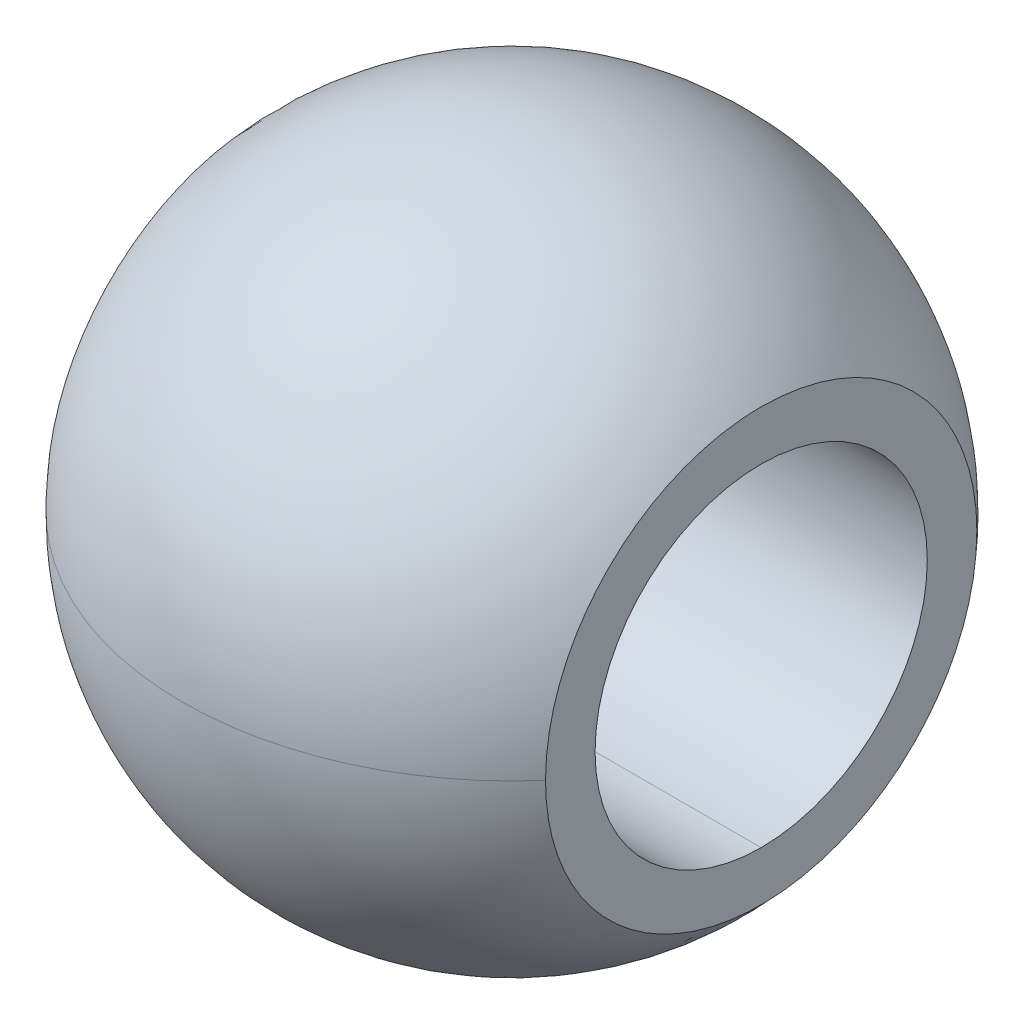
ISO-10303-21;
HEADER;
FILE_DESCRIPTION(('STEP AP214'),'2;1');
FILE_NAME('part.step','',(''),(''),'','','');
FILE_SCHEMA(('AUTOMOTIVE_DESIGN { 1 0 10303 214 1 1 1 1 }'));
ENDSEC;
DATA;
#1=APPLICATION_CONTEXT('core data for automotive mechanical design processes');
#2=APPLICATION_PROTOCOL_DEFINITION('international standard','automotive_design',2000,#1);
#3=PRODUCT_CONTEXT('',#1,'mechanical');
#4=PRODUCT('Part','Part','',(#3));
#5=PRODUCT_RELATED_PRODUCT_CATEGORY('part','',(#4));
#6=PRODUCT_DEFINITION_FORMATION('','',#4);
#7=PRODUCT_DEFINITION_CONTEXT('part definition',#1,'design');
#8=PRODUCT_DEFINITION('design','',#6,#7);
#9=PRODUCT_DEFINITION_SHAPE('','',#8);
#10=(LENGTH_UNIT() NAMED_UNIT(*) SI_UNIT(.MILLI.,.METRE.));
#11=(NAMED_UNIT(*) PLANE_ANGLE_UNIT() SI_UNIT($,.RADIAN.));
#12=(NAMED_UNIT(*) SI_UNIT($,.STERADIAN.) SOLID_ANGLE_UNIT());
#13=UNCERTAINTY_MEASURE_WITH_UNIT(LENGTH_MEASURE(1.E-05),#10,'distance_accuracy_value','');
#14=(GEOMETRIC_REPRESENTATION_CONTEXT(3) GLOBAL_UNCERTAINTY_ASSIGNED_CONTEXT((#13)) GLOBAL_UNIT_ASSIGNED_CONTEXT((#10,
#11,#12)) REPRESENTATION_CONTEXT('',''));
#15=CARTESIAN_POINT('',(0.,0.,0.));
#16=DIRECTION('',(0.,0.,1.));
#17=DIRECTION('',(1.,0.,0.));
#18=AXIS2_PLACEMENT_3D('',#15,#16,#17);
#19=CARTESIAN_POINT('',(0.,0.,0.));
#20=DIRECTION('',(-1.,0.,0.));
#21=DIRECTION('',(0.,0.,1.));
#22=AXIS2_PLACEMENT_3D('',#19,#20,#21);
#23=CYLINDRICAL_SURFACE('',#22,4.);
#24=CARTESIAN_POINT('',(-6.,0.,0.));
#25=DIRECTION('',(-1.,0.,0.));
#26=DIRECTION('',(0.,0.,1.));
#27=AXIS2_PLACEMENT_3D('',#24,#25,#26);
#28=CIRCLE('',#27,4.);
#29=CARTESIAN_POINT('',(-6.,4.,0.));
#30=VERTEX_POINT('',#29);
#31=CARTESIAN_POINT('',(-6.,-4.,0.));
#32=VERTEX_POINT('',#31);
#33=EDGE_CURVE('E68',#30,#32,#28,.T.);
#34=ORIENTED_EDGE('',*,*,#33,.T.);
#35=DIRECTION('',(-1.,0.,0.));
#36=VECTOR('',#35,1.);
#37=CARTESIAN_POINT('',(0.,-4.,0.));
#38=LINE('',#37,#36);
#39=CARTESIAN_POINT('',(6.,-4.,0.));
#40=VERTEX_POINT('',#39);
#41=EDGE_CURVE('E63',#32,#40,#38,.F.);
#42=ORIENTED_EDGE('',*,*,#41,.T.);
#43=CARTESIAN_POINT('',(6.,0.,0.));
#44=DIRECTION('',(-1.,0.,0.));
#45=DIRECTION('',(0.,0.,1.));
#46=AXIS2_PLACEMENT_3D('',#43,#44,#45);
#47=CIRCLE('',#46,4.);
#48=CARTESIAN_POINT('',(6.,4.,0.));
#49=VERTEX_POINT('',#48);
#50=EDGE_CURVE('E65',#40,#49,#47,.F.);
#51=ORIENTED_EDGE('',*,*,#50,.T.);
#52=DIRECTION('',(-1.,0.,0.));
#53=VECTOR('',#52,1.);
#54=CARTESIAN_POINT('',(0.,4.,0.));
#55=LINE('',#54,#53);
#56=EDGE_CURVE('E58',#49,#30,#55,.T.);
#57=ORIENTED_EDGE('',*,*,#56,.T.);
#58=EDGE_LOOP('',(#34,#42,#51,#57));
#59=FACE_BOUND('',#58,.T.);
#60=ADVANCED_FACE('F14',(#59),#23,.F.);
#61=CARTESIAN_POINT('',(0.,0.,0.));
#62=DIRECTION('',(-1.,0.,0.));
#63=DIRECTION('',(0.,0.,1.));
#64=AXIS2_PLACEMENT_3D('',#61,#62,#63);
#65=CYLINDRICAL_SURFACE('',#64,4.);
#66=CARTESIAN_POINT('',(6.,0.,0.));
#67=DIRECTION('',(-1.,0.,0.));
#68=DIRECTION('',(0.,0.,1.));
#69=AXIS2_PLACEMENT_3D('',#66,#67,#68);
#70=CIRCLE('',#69,4.);
#71=EDGE_CURVE('E17',#49,#40,#70,.F.);
#72=ORIENTED_EDGE('',*,*,#71,.T.);
#73=ORIENTED_EDGE('',*,*,#41,.F.);
#74=CARTESIAN_POINT('',(-6.,0.,0.));
#75=DIRECTION('',(-1.,0.,0.));
#76=DIRECTION('',(0.,0.,1.));
#77=AXIS2_PLACEMENT_3D('',#74,#75,#76);
#78=CIRCLE('',#77,4.);
#79=EDGE_CURVE('E154',#32,#30,#78,.T.);
#80=ORIENTED_EDGE('',*,*,#79,.T.);
#81=ORIENTED_EDGE('',*,*,#56,.F.);
#82=EDGE_LOOP('',(#72,#73,#80,#81));
#83=FACE_BOUND('',#82,.T.);
#84=ADVANCED_FACE('F71',(#83),#65,.F.);
#85=CARTESIAN_POINT('',(6.,15.87,-15.87));
#86=DIRECTION('',(-1.,0.,0.));
#87=DIRECTION('',(0.,0.,1.));
#88=AXIS2_PLACEMENT_3D('',#85,#86,#87);
#89=PLANE('',#88);
#90=CARTESIAN_POINT('',(6.,0.,5.19270883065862));
#91=CARTESIAN_POINT('',(6.,0.146050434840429,5.19272453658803));
#92=CARTESIAN_POINT('',(6.,0.292098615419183,5.1865477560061));
#93=CARTESIAN_POINT('',(6.,0.583150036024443,5.16192265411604));
#94=CARTESIAN_POINT('',(6.,0.728153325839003,5.14347492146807));
#95=CARTESIAN_POINT('',(6.,1.01597995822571,5.09443986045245));
#96=CARTESIAN_POINT('',(6.,1.15880486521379,5.06386171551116));
#97=CARTESIAN_POINT('',(6.,1.44137084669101,4.99078826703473));
#98=CARTESIAN_POINT('',(6.,1.58111195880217,4.94829310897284));
#99=CARTESIAN_POINT('',(6.,1.85656111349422,4.85167137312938));
#100=CARTESIAN_POINT('',(6.,1.99226792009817,4.79754127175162));
#101=CARTESIAN_POINT('',(6.,2.25868874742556,4.67802031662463));
#102=CARTESIAN_POINT('',(6.,2.38940091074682,4.6126253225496));
#103=CARTESIAN_POINT('',(6.,2.64478150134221,4.47109128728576));
#104=CARTESIAN_POINT('',(6.,2.76945311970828,4.39495800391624));
#105=CARTESIAN_POINT('',(6.,3.01198366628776,4.23243376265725));
#106=CARTESIAN_POINT('',(6.,3.12984021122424,4.14603924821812));
#107=CARTESIAN_POINT('',(6.,3.35783462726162,3.96364478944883));
#108=CARTESIAN_POINT('',(6.,3.46797391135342,3.86764661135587));
#109=CARTESIAN_POINT('',(6.,3.67977473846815,3.66671396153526));
#110=CARTESIAN_POINT('',(6.,3.78143628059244,3.56177948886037));
#111=CARTESIAN_POINT('',(6.,3.9755949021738,3.34367974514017));
#112=CARTESIAN_POINT('',(6.,4.06808858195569,3.23051144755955));
#113=CARTESIAN_POINT('',(6.,4.24318040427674,2.99682408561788));
#114=CARTESIAN_POINT('',(6.,4.32578196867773,2.87630758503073));
#115=CARTESIAN_POINT('',(6.,4.48058243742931,2.62867615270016));
#116=CARTESIAN_POINT('',(6.,4.55277558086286,2.50155761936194));
#117=CARTESIAN_POINT('',(6.,4.68616678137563,2.24173701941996));
#118=CARTESIAN_POINT('',(6.,4.74736882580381,2.10903699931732));
#119=CARTESIAN_POINT('',(6.,4.85835958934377,1.83898549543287));
#120=CARTESIAN_POINT('',(6.,4.90815156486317,1.7016353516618));
#121=CARTESIAN_POINT('',(6.,4.995978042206,1.42328332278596));
#122=CARTESIAN_POINT('',(6.,5.03401537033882,1.28228232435));
#123=CARTESIAN_POINT('',(6.,5.10812091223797,0.952900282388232));
#124=CARTESIAN_POINT('',(6.,5.13984033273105,0.763512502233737));
#125=CARTESIAN_POINT('',(6.,5.17155772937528,0.477910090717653));
#126=CARTESIAN_POINT('',(6.,5.1794865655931,0.382504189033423));
#127=CARTESIAN_POINT('',(6.,5.19006146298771,0.191406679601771));
#128=CARTESIAN_POINT('',(6.,5.19270789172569,0.0957150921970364));
#129=CARTESIAN_POINT('',(6.,5.19270883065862,0.));
#130=B_SPLINE_CURVE_WITH_KNOTS('',3,(#90,#91,#92,#93,#94,#95,#96,#97,#98,#99,#100,#101,#102,
#103,#104,#105,#106,#107,#108,#109,#110,#111,#112,#113,#114,#115,#116,#117,#118,#119,#120,#121,
#122,#123,#124,#125,#126,#127,#128,#129),.UNSPECIFIED.,.F.,.F.,(4,2,2,2,2,2,2,2,2,2,2,2,2,2,2,2,
2,2,2,4),(0.,0.438017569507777,0.876014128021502,1.31367972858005,1.75133998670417,
2.18913297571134,2.62708721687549,3.06480751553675,3.50267997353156,3.94047204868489,
4.37826417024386,4.8162180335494,5.25401996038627,5.69206328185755,6.12994736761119,
6.56770632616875,7.005359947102,7.58010065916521,7.86718242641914,8.15424421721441),.UNSPECIFIED.);
#131=CARTESIAN_POINT('',(6.,0.,5.19270883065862));
#132=VERTEX_POINT('',#131);
#133=CARTESIAN_POINT('',(6.,5.19270883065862,0.));
#134=VERTEX_POINT('',#133);
#135=EDGE_CURVE('E74',#132,#134,#130,.T.);
#136=ORIENTED_EDGE('',*,*,#135,.F.);
#137=CARTESIAN_POINT('',(6.,-1.20823490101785E-12,-5.19270883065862));
#138=CARTESIAN_POINT('',(6.,-0.146046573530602,-5.19272453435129));
#139=CARTESIAN_POINT('',(6.,-0.292090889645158,-5.18654808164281));
#140=CARTESIAN_POINT('',(6.,-0.583134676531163,-5.16192428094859));
#141=CARTESIAN_POINT('',(6.,-0.728134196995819,-5.14347752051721));
#142=CARTESIAN_POINT('',(6.,-1.01596105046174,-5.09444374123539));
#143=CARTESIAN_POINT('',(6.,-1.15878983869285,-5.06386526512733));
#144=CARTESIAN_POINT('',(6.,-1.44136345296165,-4.99079051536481));
#145=CARTESIAN_POINT('',(6.,-1.58110831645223,-4.94829438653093));
#146=CARTESIAN_POINT('',(6.,-1.85656243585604,-4.85167090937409));
#147=CARTESIAN_POINT('',(6.,-1.99227052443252,-4.79754023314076));
#148=CARTESIAN_POINT('',(6.,-2.25869396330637,-4.67801784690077));
#149=CARTESIAN_POINT('',(6.,-2.38940745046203,-4.6126219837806));
#150=CARTESIAN_POINT('',(6.,-2.64478649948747,-4.47108823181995));
#151=CARTESIAN_POINT('',(6.,-2.76945544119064,-4.3949564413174));
#152=CARTESIAN_POINT('',(6.,-3.01198353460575,-4.23243385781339));
#153=CARTESIAN_POINT('',(6.,-3.12984015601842,-4.14603928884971));
#154=CARTESIAN_POINT('',(6.,-3.35781605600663,-3.96365964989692));
#155=CARTESIAN_POINT('',(6.,-3.46793800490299,-3.86767791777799));
#156=CARTESIAN_POINT('',(6.,-3.67974619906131,-3.66674379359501));
#157=CARTESIAN_POINT('',(6.,-3.78142931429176,-3.56178810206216));
#158=CARTESIAN_POINT('',(6.,-3.97557027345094,-3.34370662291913));
#159=CARTESIAN_POINT('',(6.,-4.06803011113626,-3.23058261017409));
#160=CARTESIAN_POINT('',(6.,-4.24312476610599,-2.99690521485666));
#161=CARTESIAN_POINT('',(6.,-4.32575594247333,-2.87634910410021));
#162=CARTESIAN_POINT('',(6.,-4.48053380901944,-2.62875405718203));
#163=CARTESIAN_POINT('',(6.,-4.55268481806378,-2.50171782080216));
#164=CARTESIAN_POINT('',(6.,-4.68605489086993,-2.24197152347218));
#165=CARTESIAN_POINT('',(6.,-4.74726990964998,-2.10925938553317));
#166=CARTESIAN_POINT('',(6.,-4.85827581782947,-1.8392075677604));
#167=CARTESIAN_POINT('',(6.,-4.90807163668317,-1.7018699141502));
#168=CARTESIAN_POINT('',(6.,-4.99593538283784,-1.42343726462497));
#169=CARTESIAN_POINT('',(6.,-5.03399898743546,-1.28234090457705));
#170=CARTESIAN_POINT('',(6.,-5.0980919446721,-0.997490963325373));
#171=CARTESIAN_POINT('',(6.,-5.12412535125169,-0.853738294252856));
#172=CARTESIAN_POINT('',(6.,-5.163998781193,-0.564500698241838));
#173=CARTESIAN_POINT('',(6.,-5.17783456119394,-0.419015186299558));
#174=CARTESIAN_POINT('',(6.,-5.19319774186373,-0.127417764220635));
#175=CARTESIAN_POINT('',(6.,-5.19472699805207,0.0186940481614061));
#176=CARTESIAN_POINT('',(6.,-5.18547114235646,0.310527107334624));
#177=CARTESIAN_POINT('',(6.,-5.1746860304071,0.456248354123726));
#178=CARTESIAN_POINT('',(6.,-5.14087532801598,0.746288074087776));
#179=CARTESIAN_POINT('',(6.,-5.11784773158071,0.89060631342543));
#180=CARTESIAN_POINT('',(6.,-5.05972472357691,1.17673955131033));
#181=CARTESIAN_POINT('',(6.,-5.02463350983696,1.31855540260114));
#182=CARTESIAN_POINT('',(6.,-4.94261636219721,1.59877728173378));
#183=CARTESIAN_POINT('',(6.,-4.89568623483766,1.73718208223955));
#184=CARTESIAN_POINT('',(6.,-4.79035062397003,2.009495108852));
#185=CARTESIAN_POINT('',(6.,-4.73194936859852,2.14340497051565));
#186=CARTESIAN_POINT('',(6.,-4.60405029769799,2.40588181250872));
#187=CARTESIAN_POINT('',(6.,-4.53454810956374,2.53444666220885));
#188=CARTESIAN_POINT('',(6.,-4.38498569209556,2.78521655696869));
#189=CARTESIAN_POINT('',(6.,-4.30492936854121,2.90742393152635));
#190=CARTESIAN_POINT('',(6.,-4.13478055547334,3.14469936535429));
#191=CARTESIAN_POINT('',(6.,-4.04468486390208,3.25976512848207));
#192=CARTESIAN_POINT('',(6.,-3.85515394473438,3.48185535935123));
#193=CARTESIAN_POINT('',(6.,-3.75572217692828,3.58888277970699));
#194=CARTESIAN_POINT('',(6.,-3.54817319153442,3.79420684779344));
#195=CARTESIAN_POINT('',(6.,-3.44005394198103,3.89250144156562));
#196=CARTESIAN_POINT('',(6.,-3.215960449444,4.07959818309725));
#197=CARTESIAN_POINT('',(6.,-3.09998911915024,4.16840381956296));
#198=CARTESIAN_POINT('',(6.,-2.86089749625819,4.33599097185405));
#199=CARTESIAN_POINT('',(6.,-2.73777234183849,4.41476555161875));
#200=CARTESIAN_POINT('',(6.,-2.48536821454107,4.56163142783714));
#201=CARTESIAN_POINT('',(6.,-2.35609153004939,4.62972665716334));
#202=CARTESIAN_POINT('',(6.,-2.09213191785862,4.75484622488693));
#203=CARTESIAN_POINT('',(6.,-1.9574438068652,4.8118596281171));
#204=CARTESIAN_POINT('',(6.,-1.68379025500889,4.91430685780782));
#205=CARTESIAN_POINT('',(6.,-1.5448264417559,4.95974503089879));
#206=CARTESIAN_POINT('',(6.,-1.26372219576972,5.03870257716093));
#207=CARTESIAN_POINT('',(6.,-1.12158543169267,5.07223502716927));
#208=CARTESIAN_POINT('',(6.,-0.83504956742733,5.1272002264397));
#209=CARTESIAN_POINT('',(6.,-0.690651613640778,5.14863891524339));
#210=CARTESIAN_POINT('',(6.,-0.454949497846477,5.17354483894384));
#211=CARTESIAN_POINT('',(6.,-0.364022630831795,5.18073591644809));
#212=CARTESIAN_POINT('',(6.,-0.182066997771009,5.19031447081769));
#213=CARTESIAN_POINT('',(6.,-0.0910386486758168,5.19270986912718));
#214=CARTESIAN_POINT('',(6.,0.,5.19270883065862));
#215=B_SPLINE_CURVE_WITH_KNOTS('',3,(#137,#138,#139,#140,#141,#142,#143,#144,#145,#146,#147,
#148,#149,#150,#151,#152,#153,#154,#155,#156,#157,#158,#159,#160,#161,#162,#163,#164,#165,#166,
#167,#168,#169,#170,#171,#172,#173,#174,#175,#176,#177,#178,#179,#180,#181,#182,#183,#184,#185,
#186,#187,#188,#189,#190,#191,#192,#193,#194,#195,#196,#197,#198,#199,#200,#201,#202,#203,#204,
#205,#206,#207,#208,#209,#210,#211,#212,#213,#214),.UNSPECIFIED.,.F.,.F.,(4,2,2,2,2,2,2,2,2,2,2,
2,2,2,2,2,2,2,2,2,2,2,2,2,2,2,2,2,2,2,2,2,2,2,2,2,2,2,4),(0.,0.438005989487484,
0.875991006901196,1.31366815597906,1.7513399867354,2.18913717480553,2.62709611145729,
3.06480726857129,3.50267997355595,3.94040075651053,4.37828317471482,4.81607073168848,
5.25401996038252,5.69178819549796,6.12971801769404,6.56745843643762,7.00535994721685,
7.44311378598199,7.88101985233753,8.31885989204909,8.75669993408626,9.19461174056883,
9.6323713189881,10.0702861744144,10.5080399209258,10.9459665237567,11.3837315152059,
11.8216365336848,12.2593799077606,12.6972259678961,13.1349104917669,13.5728960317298,
14.0107198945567,14.4489736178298,14.8870625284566,15.3246687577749,15.7620598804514,
16.0355760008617,16.3086399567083),.UNSPECIFIED.);
#216=CARTESIAN_POINT('',(6.,-1.20765665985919E-12,-5.19270883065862));
#217=VERTEX_POINT('',#216);
#218=EDGE_CURVE('E151',#217,#132,#215,.T.);
#219=ORIENTED_EDGE('',*,*,#218,.F.);
#220=CARTESIAN_POINT('',(6.,5.19270883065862,0.));
#221=CARTESIAN_POINT('',(6.,5.19272453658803,-0.146050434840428));
#222=CARTESIAN_POINT('',(6.,5.1865477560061,-0.292098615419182));
#223=CARTESIAN_POINT('',(6.,5.16192265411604,-0.583150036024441));
#224=CARTESIAN_POINT('',(6.,5.14347492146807,-0.728153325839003));
#225=CARTESIAN_POINT('',(6.,5.09443986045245,-1.01597995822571));
#226=CARTESIAN_POINT('',(6.,5.06386171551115,-1.15880486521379));
#227=CARTESIAN_POINT('',(6.,4.99078826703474,-1.44137084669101));
#228=CARTESIAN_POINT('',(6.,4.94829310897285,-1.58111195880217));
#229=CARTESIAN_POINT('',(6.,4.85167137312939,-1.85656111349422));
#230=CARTESIAN_POINT('',(6.,4.79754127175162,-1.99226792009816));
#231=CARTESIAN_POINT('',(6.,4.67802031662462,-2.25868874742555));
#232=CARTESIAN_POINT('',(6.,4.6126253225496,-2.38940091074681));
#233=CARTESIAN_POINT('',(6.,4.47109128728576,-2.6447815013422));
#234=CARTESIAN_POINT('',(6.,4.39495800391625,-2.76945311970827));
#235=CARTESIAN_POINT('',(6.,4.23243376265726,-3.01198366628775));
#236=CARTESIAN_POINT('',(6.,4.14603924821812,-3.12984021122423));
#237=CARTESIAN_POINT('',(6.,3.96364478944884,-3.35783462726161));
#238=CARTESIAN_POINT('',(6.,3.86764661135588,-3.46797391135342));
#239=CARTESIAN_POINT('',(6.,3.66671396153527,-3.67977473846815));
#240=CARTESIAN_POINT('',(6.,3.56177948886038,-3.78143628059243));
#241=CARTESIAN_POINT('',(6.,3.34367974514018,-3.9755949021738));
#242=CARTESIAN_POINT('',(6.,3.23051144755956,-4.06808858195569));
#243=CARTESIAN_POINT('',(6.,2.99682408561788,-4.24318040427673));
#244=CARTESIAN_POINT('',(6.,2.87630758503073,-4.32578196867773));
#245=CARTESIAN_POINT('',(6.,2.62867615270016,-4.4805824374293));
#246=CARTESIAN_POINT('',(6.,2.50155761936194,-4.55277558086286));
#247=CARTESIAN_POINT('',(6.,2.24173701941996,-4.68616678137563));
#248=CARTESIAN_POINT('',(6.,2.10903699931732,-4.74736882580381));
#249=CARTESIAN_POINT('',(6.,1.83898549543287,-4.85835958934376));
#250=CARTESIAN_POINT('',(6.,1.7016353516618,-4.90815156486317));
#251=CARTESIAN_POINT('',(6.,1.42328332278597,-4.995978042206));
#252=CARTESIAN_POINT('',(6.,1.28228232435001,-5.03401537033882));
#253=CARTESIAN_POINT('',(6.,0.952900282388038,-5.10812091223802));
#254=CARTESIAN_POINT('',(6.,0.763512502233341,-5.13984033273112));
#255=CARTESIAN_POINT('',(6.,0.47791009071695,-5.17155772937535));
#256=CARTESIAN_POINT('',(6.,0.382504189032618,-5.17948656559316));
#257=CARTESIAN_POINT('',(6.,0.191406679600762,-5.19006146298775));
#258=CARTESIAN_POINT('',(6.,0.0957150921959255,-5.19270789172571));
#259=CARTESIAN_POINT('',(6.,-1.21257170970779E-12,-5.19270883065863));
#260=B_SPLINE_CURVE_WITH_KNOTS('',3,(#220,#221,#222,#223,#224,#225,#226,#227,#228,#229,#230,
#231,#232,#233,#234,#235,#236,#237,#238,#239,#240,#241,#242,#243,#244,#245,#246,#247,#248,#249,
#250,#251,#252,#253,#254,#255,#256,#257,#258,#259),.UNSPECIFIED.,.F.,.F.,(4,2,2,2,2,2,2,2,2,2,2,
2,2,2,2,2,2,2,2,4),(0.,0.438017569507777,0.876014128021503,1.31367972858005,1.75133998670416,
2.18913297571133,2.62708721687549,3.06480751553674,3.50267997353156,3.94047204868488,
4.37826417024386,4.8162180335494,5.25401996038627,5.69206328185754,6.12994736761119,
6.56770632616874,7.00535994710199,7.58010065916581,7.86718242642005,8.15424421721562),.UNSPECIFIED.);
#261=EDGE_CURVE('E76',#134,#217,#260,.T.);
#262=ORIENTED_EDGE('',*,*,#261,.F.);
#263=EDGE_LOOP('',(#136,#219,#262));
#264=FACE_BOUND('',#263,.T.);
#265=ORIENTED_EDGE('',*,*,#71,.F.);
#266=ORIENTED_EDGE('',*,*,#50,.F.);
#267=EDGE_LOOP('',(#265,#266));
#268=FACE_BOUND('',#267,.T.);
#269=ADVANCED_FACE('F73',(#264,#268),#89,.F.);
#270=CARTESIAN_POINT('',(0.,0.,0.));
#271=DIRECTION('',(0.,0.,-1.));
#272=DIRECTION('',(0.,1.,0.));
#273=AXIS2_PLACEMENT_3D('',#270,#271,#272);
#274=SPHERICAL_SURFACE('',#273,7.935);
#275=ORIENTED_EDGE('',*,*,#135,.T.);
#276=ORIENTED_EDGE('',*,*,#261,.T.);
#277=CARTESIAN_POINT('',(0.,0.,-7.935));
#278=CARTESIAN_POINT('',(0.141739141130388,-1.71264184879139E-13,-7.93500391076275));
#279=CARTESIAN_POINT('',(0.283477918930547,-3.4252793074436E-13,-7.93120242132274));
#280=CARTESIAN_POINT('',(0.566548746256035,-6.84563970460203E-13,-7.91601672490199));
#281=CARTESIAN_POINT('',(0.707880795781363,-8.55336264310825E-13,-7.90463251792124));
#282=CARTESIAN_POINT('',(0.989732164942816,-1.1958988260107E-12,-7.87430946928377));
#283=CARTESIAN_POINT('',(1.13025148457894,-1.36568909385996E-12,-7.85537062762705));
#284=CARTESIAN_POINT('',(1.41007403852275,-1.70380022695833E-12,-7.80999391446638));
#285=CARTESIAN_POINT('',(1.54937727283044,-1.87212109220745E-12,-7.78355604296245));
#286=CARTESIAN_POINT('',(1.82636770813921,-2.20681016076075E-12,-7.72325684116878));
#287=CARTESIAN_POINT('',(1.9640549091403,-2.37317836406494E-12,-7.68939551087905));
#288=CARTESIAN_POINT('',(2.23741799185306,-2.70348448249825E-12,-7.6143466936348));
#289=CARTESIAN_POINT('',(2.37309387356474,-2.86742239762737E-12,-7.57315920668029));
#290=CARTESIAN_POINT('',(2.64204480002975,-3.19239728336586E-12,-7.4835762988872));
#291=CARTESIAN_POINT('',(2.77531984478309,-3.35343425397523E-12,-7.43518087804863));
#292=CARTESIAN_POINT('',(3.0390864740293,-3.67214492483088E-12,-7.33132104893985));
#293=CARTESIAN_POINT('',(3.16957805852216,-3.82981862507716E-12,-7.27585664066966));
#294=CARTESIAN_POINT('',(3.42740313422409,-4.14135008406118E-12,-7.15801806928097));
#295=CARTESIAN_POINT('',(3.55473662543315,-4.29520784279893E-12,-7.09564390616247));
#296=CARTESIAN_POINT('',(3.80587994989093,-4.59866570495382E-12,-6.96416489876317));
#297=CARTESIAN_POINT('',(3.92968978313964,-4.74826580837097E-12,-6.89506005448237));
#298=CARTESIAN_POINT('',(4.17343033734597,-5.04277886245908E-12,-6.75031807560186));
#299=CARTESIAN_POINT('',(4.29336105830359,-5.18769181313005E-12,-6.67468094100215));
#300=CARTESIAN_POINT('',(4.52899909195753,-5.47241454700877E-12,-6.51709154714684));
#301=CARTESIAN_POINT('',(4.64470640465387,-5.61222433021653E-12,-6.43513928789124));
#302=CARTESIAN_POINT('',(4.87156537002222,-5.88633926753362E-12,-6.2651548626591));
#303=CARTESIAN_POINT('',(4.98271702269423,-6.02064442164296E-12,-6.17712269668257));
#304=CARTESIAN_POINT('',(5.20014579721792,-6.28336480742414E-12,-5.99523142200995));
#305=CARTESIAN_POINT('',(5.30642291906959,-6.41178003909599E-12,-5.90137231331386));
#306=CARTESIAN_POINT('',(5.51379662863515,-6.66235083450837E-12,-5.7080957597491));
#307=CARTESIAN_POINT('',(5.61489321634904,-6.78450639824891E-12,-5.60867831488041));
#308=CARTESIAN_POINT('',(5.81161893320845,-7.0222111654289E-12,-5.40457370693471));
#309=CARTESIAN_POINT('',(5.90724806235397,-7.13776036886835E-12,-5.29988654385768));
#310=CARTESIAN_POINT('',(6.,-7.24983304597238E-12,-5.19270883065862));
#311=B_SPLINE_CURVE_WITH_KNOTS('',3,(#277,#278,#279,#280,#281,#282,#283,#284,#285,#286,#287,
#288,#289,#290,#291,#292,#293,#294,#295,#296,#297,#298,#299,#300,#301,#302,#303,#304,#305,#306,
#307,#308,#309,#310),.UNSPECIFIED.,.F.,.F.,(4,2,2,2,2,2,2,2,2,2,2,2,2,2,2,2,4),(0.,
0.425165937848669,0.850331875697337,1.27549781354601,1.70066375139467,2.12582968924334,
2.55099562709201,2.97616156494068,3.40132750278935,3.82649344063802,4.25165937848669,
4.67682531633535,5.10199125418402,5.52715719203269,5.95232312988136,6.37748906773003,
6.8026550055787),.UNSPECIFIED.);
#312=CARTESIAN_POINT('',(0.,0.,-7.935));
#313=VERTEX_POINT('',#312);
#314=EDGE_CURVE('E145',#313,#217,#311,.T.);
#315=ORIENTED_EDGE('',*,*,#314,.F.);
#316=CARTESIAN_POINT('',(0.,0.,0.));
#317=DIRECTION('',(-1.20721816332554E-12,1.,0.));
#318=DIRECTION('',(0.,0.,-1.));
#319=AXIS2_PLACEMENT_3D('',#316,#317,#318);
#320=CIRCLE('',#319,7.935);
#321=CARTESIAN_POINT('',(-6.,-4.22447089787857E-12,-5.19270883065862));
#322=VERTEX_POINT('',#321);
#323=EDGE_CURVE('E147',#322,#313,#320,.F.);
#324=ORIENTED_EDGE('',*,*,#323,.F.);
#325=CARTESIAN_POINT('',(-6.,-1.20563281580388E-12,-5.19270883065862));
#326=CARTESIAN_POINT('',(-6.,0.146046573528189,-5.19272453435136));
#327=CARTESIAN_POINT('',(-6.,0.292090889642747,-5.18654808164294));
#328=CARTESIAN_POINT('',(-6.,0.583134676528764,-5.16192428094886));
#329=CARTESIAN_POINT('',(-6.,0.728134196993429,-5.14347752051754));
#330=CARTESIAN_POINT('',(-6.,1.01596105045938,-5.09444374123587));
#331=CARTESIAN_POINT('',(-6.,1.1587898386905,-5.06386526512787));
#332=CARTESIAN_POINT('',(-6.,1.44136345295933,-4.99079051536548));
#333=CARTESIAN_POINT('',(-6.,1.58110831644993,-4.94829438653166));
#334=CARTESIAN_POINT('',(-6.,1.85656243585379,-4.85167090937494));
#335=CARTESIAN_POINT('',(-6.,1.99227052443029,-4.79754023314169));
#336=CARTESIAN_POINT('',(-6.,2.25869396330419,-4.67801784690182));
#337=CARTESIAN_POINT('',(-6.,2.38940745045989,-4.61262198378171));
#338=CARTESIAN_POINT('',(-6.,2.6447864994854,-4.47108823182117));
#339=CARTESIAN_POINT('',(-6.,2.7694554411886,-4.39495644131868));
#340=CARTESIAN_POINT('',(-6.,3.01198353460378,-4.23243385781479));
#341=CARTESIAN_POINT('',(-6.,3.12984015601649,-4.14603928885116));
#342=CARTESIAN_POINT('',(-6.,3.35781605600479,-3.96365964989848));
#343=CARTESIAN_POINT('',(-6.,3.4679380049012,-3.8676779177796));
#344=CARTESIAN_POINT('',(-6.,3.67974619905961,-3.66674379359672));
#345=CARTESIAN_POINT('',(-6.,3.78142931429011,-3.56178810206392));
#346=CARTESIAN_POINT('',(-6.,3.97557027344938,-3.34370662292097));
#347=CARTESIAN_POINT('',(-6.,4.06803011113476,-3.23058261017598));
#348=CARTESIAN_POINT('',(-6.,4.2431247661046,-2.99690521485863));
#349=CARTESIAN_POINT('',(-6.,4.325755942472,-2.87634910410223));
#350=CARTESIAN_POINT('',(-6.,4.48053380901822,-2.62875405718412));
#351=CARTESIAN_POINT('',(-6.,4.55268481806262,-2.50171782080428));
#352=CARTESIAN_POINT('',(-6.,4.68605489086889,-2.24197152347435));
#353=CARTESIAN_POINT('',(-6.,4.747269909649,-2.10925938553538));
#354=CARTESIAN_POINT('',(-6.,4.85827581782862,-1.83920756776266));
#355=CARTESIAN_POINT('',(-6.,4.90807163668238,-1.70186991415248));
#356=CARTESIAN_POINT('',(-6.,4.99593538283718,-1.42343726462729));
#357=CARTESIAN_POINT('',(-6.,5.03399898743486,-1.28234090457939));
#358=CARTESIAN_POINT('',(-6.,5.09809194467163,-0.99749096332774));
#359=CARTESIAN_POINT('',(-6.,5.12412535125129,-0.853738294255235));
#360=CARTESIAN_POINT('',(-6.,5.16399878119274,-0.564500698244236));
#361=CARTESIAN_POINT('',(-6.,5.17783456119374,-0.419015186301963));
#362=CARTESIAN_POINT('',(-6.,5.19319774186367,-0.127417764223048));
#363=CARTESIAN_POINT('',(-6.,5.19472699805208,0.0186940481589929));
#364=CARTESIAN_POINT('',(-6.,5.1854711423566,0.310527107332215));
#365=CARTESIAN_POINT('',(-6.,5.17468603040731,0.456248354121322));
#366=CARTESIAN_POINT('',(-6.,5.14087532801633,0.746288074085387));
#367=CARTESIAN_POINT('',(-6.,5.11784773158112,0.890606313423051));
#368=CARTESIAN_POINT('',(-6.,5.05972472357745,1.17673955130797));
#369=CARTESIAN_POINT('',(-6.,5.02463350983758,1.3185554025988));
#370=CARTESIAN_POINT('',(-6.,4.94261636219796,1.59877728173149));
#371=CARTESIAN_POINT('',(-6.,4.89568623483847,1.73718208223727));
#372=CARTESIAN_POINT('',(-6.,4.79035062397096,2.00949510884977));
#373=CARTESIAN_POINT('',(-6.,4.73194936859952,2.14340497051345));
#374=CARTESIAN_POINT('',(-6.,4.60405029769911,2.40588181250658));
#375=CARTESIAN_POINT('',(-6.,4.53454810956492,2.53444666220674));
#376=CARTESIAN_POINT('',(-6.,4.38498569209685,2.78521655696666));
#377=CARTESIAN_POINT('',(-6.,4.30492936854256,2.90742393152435));
#378=CARTESIAN_POINT('',(-6.,4.1347805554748,3.14469936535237));
#379=CARTESIAN_POINT('',(-6.,4.0446848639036,3.25976512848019));
#380=CARTESIAN_POINT('',(-6.,3.855153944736,3.48185535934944));
#381=CARTESIAN_POINT('',(-6.,3.75572217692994,3.58888277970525));
#382=CARTESIAN_POINT('',(-6.,3.54817319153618,3.7942068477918));
#383=CARTESIAN_POINT('',(-6.,3.44005394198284,3.89250144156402));
#384=CARTESIAN_POINT('',(-6.,3.21596044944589,4.07959818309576));
#385=CARTESIAN_POINT('',(-6.,3.09998911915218,4.16840381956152));
#386=CARTESIAN_POINT('',(-6.,2.8608974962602,4.33599097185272));
#387=CARTESIAN_POINT('',(-6.,2.73777234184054,4.41476555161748));
#388=CARTESIAN_POINT('',(-6.,2.48536821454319,4.56163142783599));
#389=CARTESIAN_POINT('',(-6.,2.35609153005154,4.62972665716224));
#390=CARTESIAN_POINT('',(-6.,2.09213191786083,4.75484622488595));
#391=CARTESIAN_POINT('',(-6.,1.95744380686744,4.81185962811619));
#392=CARTESIAN_POINT('',(-6.,1.68379025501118,4.91430685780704));
#393=CARTESIAN_POINT('',(-6.,1.54482644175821,4.95974503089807));
#394=CARTESIAN_POINT('',(-6.,1.26372219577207,5.03870257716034));
#395=CARTESIAN_POINT('',(-6.,1.12158543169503,5.07223502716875));
#396=CARTESIAN_POINT('',(-6.,0.835049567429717,5.12720022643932));
#397=CARTESIAN_POINT('',(-6.,0.690651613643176,5.14863891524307));
#398=CARTESIAN_POINT('',(-6.,0.454949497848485,5.17354483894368));
#399=CARTESIAN_POINT('',(-6.,0.364022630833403,5.18073591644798));
#400=CARTESIAN_POINT('',(-6.,0.182066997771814,5.19031447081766));
#401=CARTESIAN_POINT('',(-6.,0.0910386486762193,5.19270986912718));
#402=CARTESIAN_POINT('',(-6.,0.,5.19270883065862));
#403=B_SPLINE_CURVE_WITH_KNOTS('',3,(#325,#326,#327,#328,#329,#330,#331,#332,#333,#334,#335,
#336,#337,#338,#339,#340,#341,#342,#343,#344,#345,#346,#347,#348,#349,#350,#351,#352,#353,#354,
#355,#356,#357,#358,#359,#360,#361,#362,#363,#364,#365,#366,#367,#368,#369,#370,#371,#372,#373,
#374,#375,#376,#377,#378,#379,#380,#381,#382,#383,#384,#385,#386,#387,#388,#389,#390,#391,#392,
#393,#394,#395,#396,#397,#398,#399,#400,#401,#402),.UNSPECIFIED.,.F.,.F.,(4,2,2,2,2,2,2,2,2,2,2,
2,2,2,2,2,2,2,2,2,2,2,2,2,2,2,2,2,2,2,2,2,2,2,2,2,2,2,4),(0.,0.438005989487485,
0.875991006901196,1.31366815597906,1.7513399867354,2.18913717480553,2.62709611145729,
3.06480726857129,3.50267997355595,3.94040075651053,4.37828317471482,4.81607073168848,
5.25401996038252,5.69178819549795,6.12971801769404,6.56745843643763,7.00535994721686,
7.44311378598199,7.88101985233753,8.31885989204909,8.75669993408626,9.19461174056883,
9.6323713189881,10.0702861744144,10.5080399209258,10.9459665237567,11.3837315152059,
11.8216365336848,12.2593799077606,12.6972259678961,13.1349104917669,13.5728960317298,
14.0107198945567,14.4489736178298,14.8870625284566,15.3246687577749,15.7620598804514,
16.0355760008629,16.3086399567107),.UNSPECIFIED.);
#404=CARTESIAN_POINT('',(-6.,0.,5.19270883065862));
#405=VERTEX_POINT('',#404);
#406=EDGE_CURVE('E152',#322,#405,#403,.T.);
#407=ORIENTED_EDGE('',*,*,#406,.T.);
#408=CARTESIAN_POINT('',(0.,0.,7.935));
#409=CARTESIAN_POINT('',(-0.141739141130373,0.,7.93500391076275));
#410=CARTESIAN_POINT('',(-0.283477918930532,0.,7.93120242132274));
#411=CARTESIAN_POINT('',(-0.566548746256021,0.,7.91601672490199));
#412=CARTESIAN_POINT('',(-0.70788079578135,0.,7.90463251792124));
#413=CARTESIAN_POINT('',(-0.989732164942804,0.,7.87430946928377));
#414=CARTESIAN_POINT('',(-1.13025148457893,0.,7.85537062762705));
#415=CARTESIAN_POINT('',(-1.41007403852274,0.,7.80999391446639));
#416=CARTESIAN_POINT('',(-1.54937727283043,0.,7.78355604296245));
#417=CARTESIAN_POINT('',(-1.8263677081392,0.,7.72325684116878));
#418=CARTESIAN_POINT('',(-1.96405490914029,0.,7.68939551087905));
#419=CARTESIAN_POINT('',(-2.23741799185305,0.,7.6143466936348));
#420=CARTESIAN_POINT('',(-2.37309387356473,0.,7.57315920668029));
#421=CARTESIAN_POINT('',(-2.64204480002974,0.,7.48357629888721));
#422=CARTESIAN_POINT('',(-2.77531984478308,0.,7.43518087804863));
#423=CARTESIAN_POINT('',(-3.03908647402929,0.,7.33132104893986));
#424=CARTESIAN_POINT('',(-3.16957805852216,0.,7.27585664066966));
#425=CARTESIAN_POINT('',(-3.42740313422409,0.,7.15801806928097));
#426=CARTESIAN_POINT('',(-3.55473662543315,0.,7.09564390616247));
#427=CARTESIAN_POINT('',(-3.80587994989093,0.,6.96416489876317));
#428=CARTESIAN_POINT('',(-3.92968978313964,0.,6.89506005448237));
#429=CARTESIAN_POINT('',(-4.17343033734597,0.,6.75031807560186));
#430=CARTESIAN_POINT('',(-4.29336105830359,0.,6.67468094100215));
#431=CARTESIAN_POINT('',(-4.52899909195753,0.,6.51709154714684));
#432=CARTESIAN_POINT('',(-4.64470640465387,0.,6.43513928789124));
#433=CARTESIAN_POINT('',(-4.87156537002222,0.,6.2651548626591));
#434=CARTESIAN_POINT('',(-4.98271702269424,0.,6.17712269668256));
#435=CARTESIAN_POINT('',(-5.20014579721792,0.,5.99523142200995));
#436=CARTESIAN_POINT('',(-5.30642291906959,0.,5.90137231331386));
#437=CARTESIAN_POINT('',(-5.51379662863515,0.,5.70809575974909));
#438=CARTESIAN_POINT('',(-5.61489321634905,0.,5.60867831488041));
#439=CARTESIAN_POINT('',(-5.81161893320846,0.,5.4045737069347));
#440=CARTESIAN_POINT('',(-5.90724806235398,0.,5.29988654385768));
#441=CARTESIAN_POINT('',(-6.00000000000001,0.,5.19270883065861));
#442=B_SPLINE_CURVE_WITH_KNOTS('',3,(#408,#409,#410,#411,#412,#413,#414,#415,#416,#417,#418,
#419,#420,#421,#422,#423,#424,#425,#426,#427,#428,#429,#430,#431,#432,#433,#434,#435,#436,#437,
#438,#439,#440,#441),.UNSPECIFIED.,.F.,.F.,(4,2,2,2,2,2,2,2,2,2,2,2,2,2,2,2,4),(0.,
0.425165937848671,0.850331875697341,1.27549781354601,1.70066375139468,2.12582968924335,
2.55099562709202,2.97616156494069,3.40132750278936,3.82649344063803,4.2516593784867,
4.67682531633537,5.10199125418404,5.52715719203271,5.95232312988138,6.37748906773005,
6.80265500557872),.UNSPECIFIED.);
#443=CARTESIAN_POINT('',(0.,0.,7.935));
#444=VERTEX_POINT('',#443);
#445=EDGE_CURVE('E113',#444,#405,#442,.T.);
#446=ORIENTED_EDGE('',*,*,#445,.F.);
#447=CARTESIAN_POINT('',(0.,0.,0.));
#448=DIRECTION('',(0.,-1.,0.));
#449=DIRECTION('',(0.,0.,-1.));
#450=AXIS2_PLACEMENT_3D('',#447,#448,#449);
#451=CIRCLE('',#450,7.935);
#452=EDGE_CURVE('E179',#132,#444,#451,.T.);
#453=ORIENTED_EDGE('',*,*,#452,.F.);
#454=EDGE_LOOP('',(#275,#276,#315,#324,#407,#446,#453));
#455=FACE_BOUND('',#454,.T.);
#456=ADVANCED_FACE('F92',(#455),#274,.T.);
#457=CARTESIAN_POINT('',(-6.,15.87,15.87));
#458=DIRECTION('',(1.,0.,0.));
#459=DIRECTION('',(0.,0.,-1.));
#460=AXIS2_PLACEMENT_3D('',#457,#458,#459);
#461=PLANE('',#460);
#462=CARTESIAN_POINT('',(-6.,0.,5.19270883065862));
#463=CARTESIAN_POINT('',(-6.,-0.14605043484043,5.19272453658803));
#464=CARTESIAN_POINT('',(-6.,-0.292098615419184,5.1865477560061));
#465=CARTESIAN_POINT('',(-6.,-0.583150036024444,5.16192265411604));
#466=CARTESIAN_POINT('',(-6.,-0.728153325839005,5.14347492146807));
#467=CARTESIAN_POINT('',(-6.,-1.01597995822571,5.09443986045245));
#468=CARTESIAN_POINT('',(-6.,-1.15880486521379,5.06386171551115));
#469=CARTESIAN_POINT('',(-6.,-1.44137084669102,4.99078826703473));
#470=CARTESIAN_POINT('',(-6.,-1.58111195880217,4.94829310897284));
#471=CARTESIAN_POINT('',(-6.,-1.85656111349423,4.85167137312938));
#472=CARTESIAN_POINT('',(-6.,-1.99226792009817,4.79754127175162));
#473=CARTESIAN_POINT('',(-6.,-2.25868874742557,4.67802031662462));
#474=CARTESIAN_POINT('',(-6.,-2.38940091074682,4.61262532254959));
#475=CARTESIAN_POINT('',(-6.,-2.64478150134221,4.47109128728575));
#476=CARTESIAN_POINT('',(-6.,-2.76945311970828,4.39495800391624));
#477=CARTESIAN_POINT('',(-6.,-3.01198366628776,4.23243376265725));
#478=CARTESIAN_POINT('',(-6.,-3.12984021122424,4.14603924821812));
#479=CARTESIAN_POINT('',(-6.,-3.35783462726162,3.96364478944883));
#480=CARTESIAN_POINT('',(-6.,-3.46797391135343,3.86764661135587));
#481=CARTESIAN_POINT('',(-6.,-3.67977473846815,3.66671396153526));
#482=CARTESIAN_POINT('',(-6.,-3.78143628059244,3.56177948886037));
#483=CARTESIAN_POINT('',(-6.,-3.9755949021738,3.34367974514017));
#484=CARTESIAN_POINT('',(-6.,-4.06808858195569,3.23051144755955));
#485=CARTESIAN_POINT('',(-6.,-4.24318040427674,2.99682408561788));
#486=CARTESIAN_POINT('',(-6.,-4.32578196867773,2.87630758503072));
#487=CARTESIAN_POINT('',(-6.,-4.48058243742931,2.62867615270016));
#488=CARTESIAN_POINT('',(-6.,-4.55277558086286,2.50155761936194));
#489=CARTESIAN_POINT('',(-6.,-4.68616678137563,2.24173701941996));
#490=CARTESIAN_POINT('',(-6.,-4.74736882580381,2.10903699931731));
#491=CARTESIAN_POINT('',(-6.,-4.85835958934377,1.83898549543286));
#492=CARTESIAN_POINT('',(-6.,-4.90815156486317,1.70163535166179));
#493=CARTESIAN_POINT('',(-6.,-4.995978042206,1.42328332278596));
#494=CARTESIAN_POINT('',(-6.,-5.03401537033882,1.28228232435));
#495=CARTESIAN_POINT('',(-6.,-5.10812091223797,0.952900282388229));
#496=CARTESIAN_POINT('',(-6.,-5.13984033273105,0.763512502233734));
#497=CARTESIAN_POINT('',(-6.,-5.17155772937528,0.477910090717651));
#498=CARTESIAN_POINT('',(-6.,-5.1794865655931,0.382504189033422));
#499=CARTESIAN_POINT('',(-6.,-5.19006146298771,0.19140667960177));
#500=CARTESIAN_POINT('',(-6.,-5.19270789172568,0.095715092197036));
#501=CARTESIAN_POINT('',(-6.,-5.19270883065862,0.));
#502=B_SPLINE_CURVE_WITH_KNOTS('',3,(#462,#463,#464,#465,#466,#467,#468,#469,#470,#471,#472,
#473,#474,#475,#476,#477,#478,#479,#480,#481,#482,#483,#484,#485,#486,#487,#488,#489,#490,#491,
#492,#493,#494,#495,#496,#497,#498,#499,#500,#501),.UNSPECIFIED.,.F.,.F.,(4,2,2,2,2,2,2,2,2,2,2,
2,2,2,2,2,2,2,2,4),(0.,0.438017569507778,0.876014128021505,1.31367972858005,1.75133998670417,
2.18913297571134,2.6270872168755,3.06480751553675,3.50267997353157,3.94047204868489,
4.37826417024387,4.8162180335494,5.25401996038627,5.69206328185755,6.1299473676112,
6.56770632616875,7.005359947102,7.58010065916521,7.86718242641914,8.15424421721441),.UNSPECIFIED.);
#503=CARTESIAN_POINT('',(-6.,-5.19270883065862,0.));
#504=VERTEX_POINT('',#503);
#505=EDGE_CURVE('E23',#405,#504,#502,.T.);
#506=ORIENTED_EDGE('',*,*,#505,.F.);
#507=ORIENTED_EDGE('',*,*,#406,.F.);
#508=CARTESIAN_POINT('',(-6.,-5.19270883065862,0.));
#509=CARTESIAN_POINT('',(-6.,-5.19272453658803,-0.146050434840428));
#510=CARTESIAN_POINT('',(-6.,-5.1865477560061,-0.292098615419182));
#511=CARTESIAN_POINT('',(-6.,-5.16192265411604,-0.583150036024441));
#512=CARTESIAN_POINT('',(-6.,-5.14347492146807,-0.728153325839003));
#513=CARTESIAN_POINT('',(-6.,-5.09443986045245,-1.01597995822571));
#514=CARTESIAN_POINT('',(-6.,-5.06386171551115,-1.15880486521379));
#515=CARTESIAN_POINT('',(-6.,-4.99078826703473,-1.44137084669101));
#516=CARTESIAN_POINT('',(-6.,-4.94829310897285,-1.58111195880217));
#517=CARTESIAN_POINT('',(-6.,-4.85167137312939,-1.85656111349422));
#518=CARTESIAN_POINT('',(-6.,-4.79754127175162,-1.99226792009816));
#519=CARTESIAN_POINT('',(-6.,-4.67802031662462,-2.25868874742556));
#520=CARTESIAN_POINT('',(-6.,-4.6126253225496,-2.38940091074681));
#521=CARTESIAN_POINT('',(-6.,-4.47109128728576,-2.6447815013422));
#522=CARTESIAN_POINT('',(-6.,-4.39495800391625,-2.76945311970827));
#523=CARTESIAN_POINT('',(-6.,-4.23243376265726,-3.01198366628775));
#524=CARTESIAN_POINT('',(-6.,-4.14603924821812,-3.12984021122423));
#525=CARTESIAN_POINT('',(-6.,-3.96364478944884,-3.35783462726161));
#526=CARTESIAN_POINT('',(-6.,-3.86764661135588,-3.46797391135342));
#527=CARTESIAN_POINT('',(-6.,-3.66671396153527,-3.67977473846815));
#528=CARTESIAN_POINT('',(-6.,-3.56177948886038,-3.78143628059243));
#529=CARTESIAN_POINT('',(-6.,-3.34367974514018,-3.9755949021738));
#530=CARTESIAN_POINT('',(-6.,-3.23051144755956,-4.06808858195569));
#531=CARTESIAN_POINT('',(-6.,-2.99682408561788,-4.24318040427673));
#532=CARTESIAN_POINT('',(-6.,-2.87630758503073,-4.32578196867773));
#533=CARTESIAN_POINT('',(-6.,-2.62867615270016,-4.4805824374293));
#534=CARTESIAN_POINT('',(-6.,-2.50155761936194,-4.55277558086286));
#535=CARTESIAN_POINT('',(-6.,-2.24173701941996,-4.68616678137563));
#536=CARTESIAN_POINT('',(-6.,-2.10903699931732,-4.74736882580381));
#537=CARTESIAN_POINT('',(-6.,-1.83898549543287,-4.85835958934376));
#538=CARTESIAN_POINT('',(-6.,-1.7016353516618,-4.90815156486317));
#539=CARTESIAN_POINT('',(-6.,-1.42328332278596,-4.995978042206));
#540=CARTESIAN_POINT('',(-6.,-1.28228232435,-5.03401537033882));
#541=CARTESIAN_POINT('',(-6.,-0.952900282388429,-5.10812091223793));
#542=CARTESIAN_POINT('',(-6.,-0.763512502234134,-5.13984033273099));
#543=CARTESIAN_POINT('',(-6.,-0.477910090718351,-5.17155772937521));
#544=CARTESIAN_POINT('',(-6.,-0.382504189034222,-5.17948656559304));
#545=CARTESIAN_POINT('',(-6.,-0.191406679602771,-5.19006146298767));
#546=CARTESIAN_POINT('',(-6.,-0.0957150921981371,-5.19270789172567));
#547=CARTESIAN_POINT('',(-6.,-1.20042864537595E-12,-5.19270883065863));
#548=B_SPLINE_CURVE_WITH_KNOTS('',3,(#508,#509,#510,#511,#512,#513,#514,#515,#516,#517,#518,
#519,#520,#521,#522,#523,#524,#525,#526,#527,#528,#529,#530,#531,#532,#533,#534,#535,#536,#537,
#538,#539,#540,#541,#542,#543,#544,#545,#546,#547),.UNSPECIFIED.,.F.,.F.,(4,2,2,2,2,2,2,2,2,2,2,
2,2,2,2,2,2,2,2,4),(0.,0.438017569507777,0.876014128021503,1.31367972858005,1.75133998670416,
2.18913297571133,2.62708721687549,3.06480751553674,3.50267997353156,3.94047204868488,
4.37826417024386,4.81621803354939,5.25401996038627,5.69206328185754,6.12994736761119,
6.56770632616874,7.005359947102,7.58010065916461,7.86718242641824,8.15424421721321),.UNSPECIFIED.);
#549=EDGE_CURVE('E9',#504,#322,#548,.T.);
#550=ORIENTED_EDGE('',*,*,#549,.F.);
#551=EDGE_LOOP('',(#506,#507,#550));
#552=FACE_BOUND('',#551,.T.);
#553=ORIENTED_EDGE('',*,*,#33,.F.);
#554=ORIENTED_EDGE('',*,*,#79,.F.);
#555=EDGE_LOOP('',(#553,#554));
#556=FACE_BOUND('',#555,.T.);
#557=ADVANCED_FACE('F97',(#552,#556),#461,.F.);
#558=CARTESIAN_POINT('',(0.,0.,0.));
#559=DIRECTION('',(0.,0.,-1.));
#560=DIRECTION('',(0.,1.,0.));
#561=AXIS2_PLACEMENT_3D('',#558,#559,#560);
#562=SPHERICAL_SURFACE('',#561,7.935);
#563=ORIENTED_EDGE('',*,*,#505,.T.);
#564=ORIENTED_EDGE('',*,*,#549,.T.);
#565=ORIENTED_EDGE('',*,*,#323,.T.);
#566=ORIENTED_EDGE('',*,*,#314,.T.);
#567=ORIENTED_EDGE('',*,*,#218,.T.);
#568=ORIENTED_EDGE('',*,*,#452,.T.);
#569=ORIENTED_EDGE('',*,*,#445,.T.);
#570=EDGE_LOOP('',(#563,#564,#565,#566,#567,#568,#569));
#571=FACE_BOUND('',#570,.T.);
#572=ADVANCED_FACE('F130',(#571),#562,.T.);
#573=CLOSED_SHELL('',(#60,#84,#269,#456,#557,#572));
#574=MANIFOLD_SOLID_BREP('B1',#573);
#575=ADVANCED_BREP_SHAPE_REPRESENTATION('',(#18,#574),#14);
#576=SHAPE_DEFINITION_REPRESENTATION(#9,#575);
ENDSEC;
END-ISO-10303-21;
